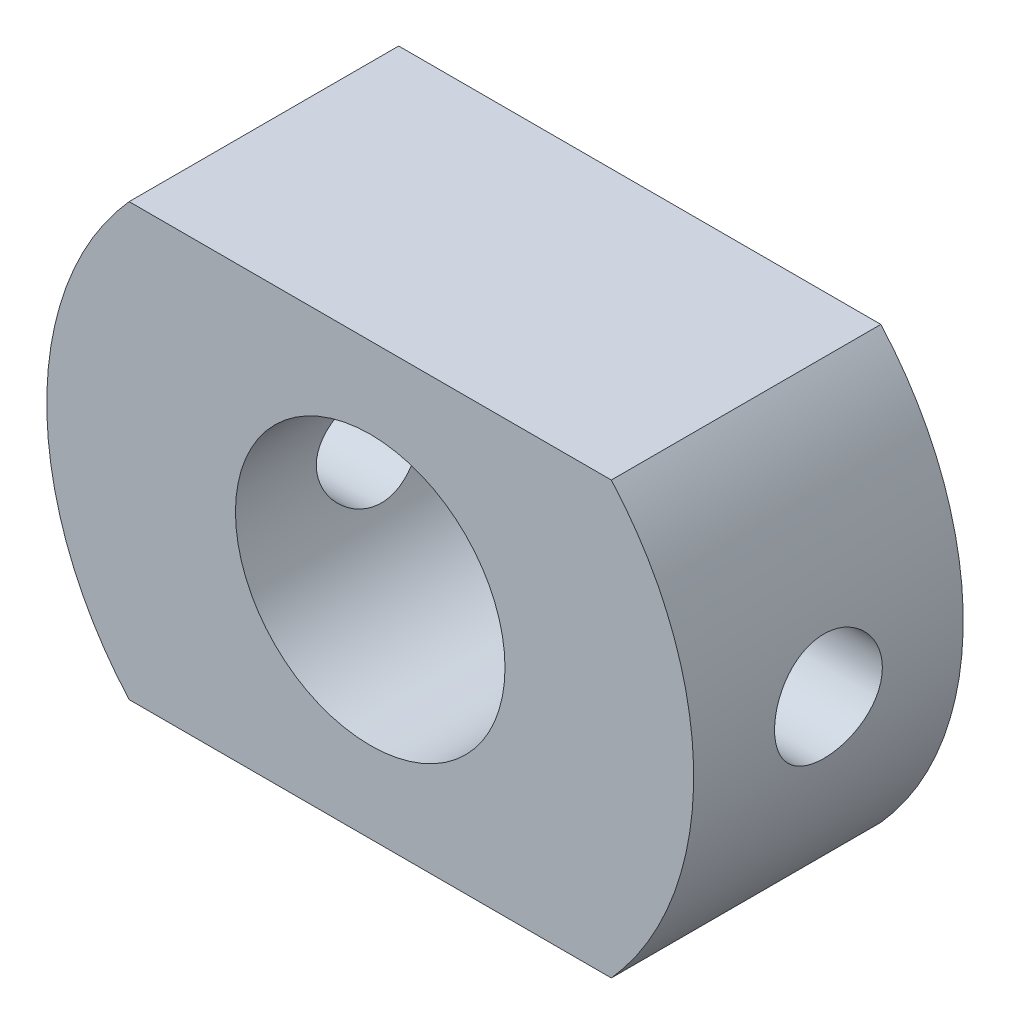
ISO-10303-21;
HEADER;
FILE_DESCRIPTION(('STEP AP214'),'2;1');
FILE_NAME('part.step','',(''),(''),'','','');
FILE_SCHEMA(('AUTOMOTIVE_DESIGN { 1 0 10303 214 1 1 1 1 }'));
ENDSEC;
DATA;
#1=APPLICATION_CONTEXT('core data for automotive mechanical design processes');
#2=APPLICATION_PROTOCOL_DEFINITION('international standard','automotive_design',2000,#1);
#3=PRODUCT_CONTEXT('',#1,'mechanical');
#4=PRODUCT('Part','Part','',(#3));
#5=PRODUCT_RELATED_PRODUCT_CATEGORY('part','',(#4));
#6=PRODUCT_DEFINITION_FORMATION('','',#4);
#7=PRODUCT_DEFINITION_CONTEXT('part definition',#1,'design');
#8=PRODUCT_DEFINITION('design','',#6,#7);
#9=PRODUCT_DEFINITION_SHAPE('','',#8);
#10=(LENGTH_UNIT() NAMED_UNIT(*) SI_UNIT(.MILLI.,.METRE.));
#11=(NAMED_UNIT(*) PLANE_ANGLE_UNIT() SI_UNIT($,.RADIAN.));
#12=(NAMED_UNIT(*) SI_UNIT($,.STERADIAN.) SOLID_ANGLE_UNIT());
#13=UNCERTAINTY_MEASURE_WITH_UNIT(LENGTH_MEASURE(1.E-05),#10,'distance_accuracy_value','');
#14=(GEOMETRIC_REPRESENTATION_CONTEXT(3) GLOBAL_UNCERTAINTY_ASSIGNED_CONTEXT((#13)) GLOBAL_UNIT_ASSIGNED_CONTEXT((#10,
#11,#12)) REPRESENTATION_CONTEXT('',''));
#15=CARTESIAN_POINT('',(0.,0.,0.));
#16=DIRECTION('',(0.,0.,1.));
#17=DIRECTION('',(1.,0.,0.));
#18=AXIS2_PLACEMENT_3D('',#15,#16,#17);
#19=CARTESIAN_POINT('',(0.,0.,5.));
#20=DIRECTION('',(0.,0.,1.));
#21=DIRECTION('',(1.,0.,0.));
#22=AXIS2_PLACEMENT_3D('',#19,#20,#21);
#23=PLANE('',#22);
#24=CARTESIAN_POINT('',(0.,0.,5.));
#25=DIRECTION('',(0.,0.,1.));
#26=DIRECTION('',(1.,0.,0.));
#27=AXIS2_PLACEMENT_3D('',#24,#25,#26);
#28=CIRCLE('',#27,6.);
#29=CARTESIAN_POINT('',(-4.47213595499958,4.,5.));
#30=VERTEX_POINT('',#29);
#31=CARTESIAN_POINT('',(-4.47213595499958,-4.,5.));
#32=VERTEX_POINT('',#31);
#33=EDGE_CURVE('E426',#30,#32,#28,.T.);
#34=ORIENTED_EDGE('',*,*,#33,.T.);
#35=DIRECTION('',(1.,0.,0.));
#36=VECTOR('',#35,1.);
#37=CARTESIAN_POINT('',(-4.47213595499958,-4.,5.));
#38=LINE('',#37,#36);
#39=CARTESIAN_POINT('',(4.47213595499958,-4.,5.));
#40=VERTEX_POINT('',#39);
#41=EDGE_CURVE('E411',#32,#40,#38,.T.);
#42=ORIENTED_EDGE('',*,*,#41,.T.);
#43=CARTESIAN_POINT('',(0.,0.,5.));
#44=DIRECTION('',(0.,0.,1.));
#45=DIRECTION('',(1.,0.,0.));
#46=AXIS2_PLACEMENT_3D('',#43,#44,#45);
#47=CIRCLE('',#46,6.);
#48=CARTESIAN_POINT('',(4.47213595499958,4.,5.));
#49=VERTEX_POINT('',#48);
#50=EDGE_CURVE('E377',#40,#49,#47,.T.);
#51=ORIENTED_EDGE('',*,*,#50,.T.);
#52=DIRECTION('',(-1.,0.,0.));
#53=VECTOR('',#52,1.);
#54=CARTESIAN_POINT('',(-4.47213595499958,4.,5.));
#55=LINE('',#54,#53);
#56=EDGE_CURVE('E372',#49,#30,#55,.T.);
#57=ORIENTED_EDGE('',*,*,#56,.T.);
#58=EDGE_LOOP('',(#34,#42,#51,#57));
#59=FACE_BOUND('',#58,.T.);
#60=CARTESIAN_POINT('',(0.,0.,5.));
#61=DIRECTION('',(0.,0.,1.));
#62=DIRECTION('',(1.,0.,0.));
#63=AXIS2_PLACEMENT_3D('',#60,#61,#62);
#64=CIRCLE('',#63,2.5);
#65=CARTESIAN_POINT('',(2.5,0.,5.));
#66=VERTEX_POINT('',#65);
#67=EDGE_CURVE('E416',#66,#66,#64,.T.);
#68=ORIENTED_EDGE('',*,*,#67,.F.);
#69=EDGE_LOOP('',(#68));
#70=FACE_BOUND('',#69,.T.);
#71=ADVANCED_FACE('F350',(#59,#70),#23,.T.);
#72=CARTESIAN_POINT('',(0.,0.,0.));
#73=DIRECTION('',(0.,0.,1.));
#74=DIRECTION('',(1.,0.,0.));
#75=AXIS2_PLACEMENT_3D('',#72,#73,#74);
#76=PLANE('',#75);
#77=CARTESIAN_POINT('',(0.,0.,0.));
#78=DIRECTION('',(0.,0.,1.));
#79=DIRECTION('',(1.,0.,0.));
#80=AXIS2_PLACEMENT_3D('',#77,#78,#79);
#81=CIRCLE('',#80,6.);
#82=CARTESIAN_POINT('',(-4.47213595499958,4.,0.));
#83=VERTEX_POINT('',#82);
#84=CARTESIAN_POINT('',(-4.47213595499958,-4.,0.));
#85=VERTEX_POINT('',#84);
#86=EDGE_CURVE('E403',#83,#85,#81,.T.);
#87=ORIENTED_EDGE('',*,*,#86,.F.);
#88=DIRECTION('',(-1.,0.,0.));
#89=VECTOR('',#88,1.);
#90=CARTESIAN_POINT('',(-4.47213595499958,4.,0.));
#91=LINE('',#90,#89);
#92=CARTESIAN_POINT('',(4.47213595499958,4.,0.));
#93=VERTEX_POINT('',#92);
#94=EDGE_CURVE('E424',#93,#83,#91,.T.);
#95=ORIENTED_EDGE('',*,*,#94,.F.);
#96=CARTESIAN_POINT('',(0.,0.,0.));
#97=DIRECTION('',(0.,0.,1.));
#98=DIRECTION('',(1.,0.,0.));
#99=AXIS2_PLACEMENT_3D('',#96,#97,#98);
#100=CIRCLE('',#99,6.);
#101=CARTESIAN_POINT('',(4.47213595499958,-4.,0.));
#102=VERTEX_POINT('',#101);
#103=EDGE_CURVE('E404',#102,#93,#100,.T.);
#104=ORIENTED_EDGE('',*,*,#103,.F.);
#105=DIRECTION('',(1.,0.,0.));
#106=VECTOR('',#105,1.);
#107=CARTESIAN_POINT('',(-4.47213595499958,-4.,0.));
#108=LINE('',#107,#106);
#109=EDGE_CURVE('E398',#85,#102,#108,.T.);
#110=ORIENTED_EDGE('',*,*,#109,.F.);
#111=EDGE_LOOP('',(#87,#95,#104,#110));
#112=FACE_BOUND('',#111,.T.);
#113=CARTESIAN_POINT('',(0.,0.,0.));
#114=DIRECTION('',(0.,0.,1.));
#115=DIRECTION('',(1.,0.,0.));
#116=AXIS2_PLACEMENT_3D('',#113,#114,#115);
#117=CIRCLE('',#116,2.5);
#118=CARTESIAN_POINT('',(2.5,0.,0.));
#119=VERTEX_POINT('',#118);
#120=EDGE_CURVE('E419',#119,#119,#117,.T.);
#121=ORIENTED_EDGE('',*,*,#120,.T.);
#122=EDGE_LOOP('',(#121));
#123=FACE_BOUND('',#122,.T.);
#124=ADVANCED_FACE('F399',(#112,#123),#76,.F.);
#125=CARTESIAN_POINT('',(0.,0.,5.));
#126=DIRECTION('',(0.,0.,-1.));
#127=DIRECTION('',(-1.,0.,0.));
#128=AXIS2_PLACEMENT_3D('',#125,#126,#127);
#129=CYLINDRICAL_SURFACE('',#128,6.);
#130=CARTESIAN_POINT('',(-6.,0.,1.5));
#131=CARTESIAN_POINT('',(-5.99999904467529,0.0557563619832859,1.50000223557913));
#132=CARTESIAN_POINT('',(-5.99921471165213,0.111543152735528,1.50467890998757));
#133=CARTESIAN_POINT('',(-5.99616137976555,0.221552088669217,1.52325426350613));
#134=CARTESIAN_POINT('',(-5.99389101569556,0.275772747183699,1.53716142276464));
#135=CARTESIAN_POINT('',(-5.9881202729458,0.381041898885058,1.5737661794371));
#136=CARTESIAN_POINT('',(-5.98462090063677,0.43209294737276,1.59645658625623));
#137=CARTESIAN_POINT('',(-5.97677690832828,0.529656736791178,1.64996491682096));
#138=CARTESIAN_POINT('',(-5.97243238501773,0.576169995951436,1.6807819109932));
#139=CARTESIAN_POINT('',(-5.96333326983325,0.663789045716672,1.74998203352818));
#140=CARTESIAN_POINT('',(-5.95857548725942,0.704845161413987,1.78842764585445));
#141=CARTESIAN_POINT('',(-5.94921050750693,0.779955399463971,1.87165918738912));
#142=CARTESIAN_POINT('',(-5.94460331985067,0.814009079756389,1.91644551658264));
#143=CARTESIAN_POINT('',(-5.93603026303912,0.874346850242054,2.01142838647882));
#144=CARTESIAN_POINT('',(-5.93206851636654,0.900581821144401,2.0616565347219));
#145=CARTESIAN_POINT('',(-5.9252791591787,0.944223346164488,2.16588382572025));
#146=CARTESIAN_POINT('',(-5.92245147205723,0.961630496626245,2.21988271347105));
#147=CARTESIAN_POINT('',(-5.91828214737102,0.986965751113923,2.32959210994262));
#148=CARTESIAN_POINT('',(-5.9169270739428,0.994979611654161,2.38528229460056));
#149=CARTESIAN_POINT('',(-5.9158157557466,1.00156669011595,2.49723211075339));
#150=CARTESIAN_POINT('',(-5.91605939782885,1.0001405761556,2.55349170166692));
#151=CARTESIAN_POINT('',(-5.91810571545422,0.987958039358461,2.66437114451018));
#152=CARTESIAN_POINT('',(-5.91989229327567,0.977297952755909,2.71900192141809));
#153=CARTESIAN_POINT('',(-5.92479798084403,0.947101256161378,2.82568852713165));
#154=CARTESIAN_POINT('',(-5.92791713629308,0.927564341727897,2.87774426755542));
#155=CARTESIAN_POINT('',(-5.9351539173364,0.880070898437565,2.97809152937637));
#156=CARTESIAN_POINT('',(-5.9392762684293,0.852074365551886,3.02636376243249));
#157=CARTESIAN_POINT('',(-5.94805167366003,0.788484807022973,3.11756176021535));
#158=CARTESIAN_POINT('',(-5.95270477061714,0.752891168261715,3.16048709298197));
#159=CARTESIAN_POINT('',(-5.96208811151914,0.674592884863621,3.24033043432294));
#160=CARTESIAN_POINT('',(-5.96681859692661,0.631805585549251,3.27716740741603));
#161=CARTESIAN_POINT('',(-5.97577040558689,0.540614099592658,3.34315110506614));
#162=CARTESIAN_POINT('',(-5.97999172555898,0.492209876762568,3.37229778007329));
#163=CARTESIAN_POINT('',(-5.98745557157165,0.391082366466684,3.42208089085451));
#164=CARTESIAN_POINT('',(-5.99069727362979,0.338355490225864,3.4427101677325));
#165=CARTESIAN_POINT('',(-5.99583001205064,0.230119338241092,3.47479768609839));
#166=CARTESIAN_POINT('',(-5.99772116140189,0.174610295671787,3.48625669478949));
#167=CARTESIAN_POINT('',(-5.99992451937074,0.0630839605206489,3.49956854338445));
#168=CARTESIAN_POINT('',(-6.00025501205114,0.00708029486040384,3.50153262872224));
#169=CARTESIAN_POINT('',(-5.99934989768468,-0.104455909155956,3.49609546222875));
#170=CARTESIAN_POINT('',(-5.99811435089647,-0.159988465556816,3.48869457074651));
#171=CARTESIAN_POINT('',(-5.99422730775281,-0.268662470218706,3.46483006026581));
#172=CARTESIAN_POINT('',(-5.99158441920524,-0.321816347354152,3.44842151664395));
#173=CARTESIAN_POINT('',(-5.98517785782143,-0.424618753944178,3.40706619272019));
#174=CARTESIAN_POINT('',(-5.98141412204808,-0.474267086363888,3.38211893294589));
#175=CARTESIAN_POINT('',(-5.97313806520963,-0.569132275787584,3.32413955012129));
#176=CARTESIAN_POINT('',(-5.96861942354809,-0.61430610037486,3.2910379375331));
#177=CARTESIAN_POINT('',(-5.9593538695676,-0.698497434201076,3.21778507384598));
#178=CARTESIAN_POINT('',(-5.95460694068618,-0.737514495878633,3.17763331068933));
#179=CARTESIAN_POINT('',(-5.94536070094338,-0.808697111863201,3.09092098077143));
#180=CARTESIAN_POINT('',(-5.94086446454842,-0.840787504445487,3.04429833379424));
#181=CARTESIAN_POINT('',(-5.93268611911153,-0.896680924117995,2.94625881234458));
#182=CARTESIAN_POINT('',(-5.92900398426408,-0.920484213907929,2.894842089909));
#183=CARTESIAN_POINT('',(-5.92289381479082,-0.95901533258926,2.78888410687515));
#184=CARTESIAN_POINT('',(-5.92046061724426,-0.973780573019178,2.7343567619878));
#185=CARTESIAN_POINT('',(-5.91711086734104,-0.993934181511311,2.62355194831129));
#186=CARTESIAN_POINT('',(-5.91619418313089,-0.999323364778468,2.56727463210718));
#187=CARTESIAN_POINT('',(-5.91598693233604,-1.00054914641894,2.45531793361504));
#188=CARTESIAN_POINT('',(-5.9166762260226,-0.996504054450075,2.39963984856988));
#189=CARTESIAN_POINT('',(-5.91955912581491,-0.979231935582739,2.28976830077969));
#190=CARTESIAN_POINT('',(-5.92175272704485,-0.96600493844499,2.23557483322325));
#191=CARTESIAN_POINT('',(-5.92738942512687,-0.930789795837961,2.13025662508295));
#192=CARTESIAN_POINT('',(-5.93083106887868,-0.908811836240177,2.07912839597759));
#193=CARTESIAN_POINT('',(-5.93857747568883,-0.856730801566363,1.98126573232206));
#194=CARTESIAN_POINT('',(-5.94288228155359,-0.826627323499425,1.93453151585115));
#195=CARTESIAN_POINT('',(-5.95193381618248,-0.758727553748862,1.8461857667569));
#196=CARTESIAN_POINT('',(-5.95668518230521,-0.720844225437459,1.80464159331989));
#197=CARTESIAN_POINT('',(-5.96605748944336,-0.638643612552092,1.72845935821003));
#198=CARTESIAN_POINT('',(-5.97067840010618,-0.594324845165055,1.69382289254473));
#199=CARTESIAN_POINT('',(-5.97930611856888,-0.500147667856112,1.63222069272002));
#200=CARTESIAN_POINT('',(-5.98330846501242,-0.450253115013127,1.60530958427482));
#201=CARTESIAN_POINT('',(-5.9902046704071,-0.346605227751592,1.56029220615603));
#202=CARTESIAN_POINT('',(-5.99309963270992,-0.292855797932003,1.54217716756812));
#203=CARTESIAN_POINT('',(-5.99682316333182,-0.19908132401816,1.51919789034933));
#204=CARTESIAN_POINT('',(-5.99800810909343,-0.159623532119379,1.51201021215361));
#205=CARTESIAN_POINT('',(-5.99959686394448,-0.0801157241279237,1.5024105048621));
#206=CARTESIAN_POINT('',(-6.00000068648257,-0.0400657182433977,1.49999839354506));
#207=CARTESIAN_POINT('',(-6.,0.,1.5));
#208=B_SPLINE_CURVE_WITH_KNOTS('',3,(#130,#131,#132,#133,#134,#135,#136,#137,#138,#139,#140,
#141,#142,#143,#144,#145,#146,#147,#148,#149,#150,#151,#152,#153,#154,#155,#156,#157,#158,#159,
#160,#161,#162,#163,#164,#165,#166,#167,#168,#169,#170,#171,#172,#173,#174,#175,#176,#177,#178,
#179,#180,#181,#182,#183,#184,#185,#186,#187,#188,#189,#190,#191,#192,#193,#194,#195,#196,#197,
#198,#199,#200,#201,#202,#203,#204,#205,#206,#207),.UNSPECIFIED.,.T.,.F.,(4,2,2,2,2,2,2,2,2,2,2,
2,2,2,2,2,2,2,2,2,2,2,2,2,2,2,2,2,2,2,2,2,2,2,2,2,2,2,4),(0.,0.167122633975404,
0.334399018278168,0.501538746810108,0.668659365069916,0.837209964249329,1.00577120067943,
1.17537008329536,1.34495750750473,1.5129843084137,1.68099921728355,1.84728208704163,
2.01357066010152,2.18065822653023,2.34775928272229,2.51693107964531,2.68610396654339,
2.85541875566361,3.0247193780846,3.19203153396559,3.35933725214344,3.52563122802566,
3.69193454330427,3.8597073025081,4.02749225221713,4.19701528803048,4.36653294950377,
4.53534408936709,4.70414055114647,4.8708316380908,5.03752218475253,5.20401927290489,
5.37052462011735,5.53900553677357,5.70752533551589,5.8772089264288,6.04672300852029,
6.16681699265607,6.28690890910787),.UNSPECIFIED.);
#209=CARTESIAN_POINT('',(-6.,0.,1.5));
#210=VERTEX_POINT('',#209);
#211=EDGE_CURVE('E457',#210,#210,#208,.T.);
#212=ORIENTED_EDGE('',*,*,#211,.T.);
#213=EDGE_LOOP('',(#212));
#214=FACE_BOUND('',#213,.T.);
#215=ORIENTED_EDGE('',*,*,#86,.T.);
#216=DIRECTION('',(0.,0.,-1.));
#217=VECTOR('',#216,1.);
#218=CARTESIAN_POINT('',(-4.47213595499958,-4.,5.));
#219=LINE('',#218,#217);
#220=EDGE_CURVE('E11',#32,#85,#219,.T.);
#221=ORIENTED_EDGE('',*,*,#220,.F.);
#222=ORIENTED_EDGE('',*,*,#33,.F.);
#223=DIRECTION('',(0.,0.,-1.));
#224=VECTOR('',#223,1.);
#225=CARTESIAN_POINT('',(-4.47213595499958,4.,5.));
#226=LINE('',#225,#224);
#227=EDGE_CURVE('E415',#30,#83,#226,.T.);
#228=ORIENTED_EDGE('',*,*,#227,.T.);
#229=EDGE_LOOP('',(#215,#221,#222,#228));
#230=FACE_BOUND('',#229,.T.);
#231=ADVANCED_FACE('F352',(#214,#230),#129,.T.);
#232=CARTESIAN_POINT('',(-4.47213595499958,-4.,5.));
#233=DIRECTION('',(0.,1.,0.));
#234=DIRECTION('',(0.,0.,1.));
#235=AXIS2_PLACEMENT_3D('',#232,#233,#234);
#236=PLANE('',#235);
#237=ORIENTED_EDGE('',*,*,#109,.T.);
#238=DIRECTION('',(0.,0.,-1.));
#239=VECTOR('',#238,1.);
#240=CARTESIAN_POINT('',(4.47213595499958,-4.,5.));
#241=LINE('',#240,#239);
#242=EDGE_CURVE('E364',#40,#102,#241,.T.);
#243=ORIENTED_EDGE('',*,*,#242,.F.);
#244=ORIENTED_EDGE('',*,*,#41,.F.);
#245=ORIENTED_EDGE('',*,*,#220,.T.);
#246=EDGE_LOOP('',(#237,#243,#244,#245));
#247=FACE_BOUND('',#246,.T.);
#248=ADVANCED_FACE('F410',(#247),#236,.F.);
#249=CARTESIAN_POINT('',(0.,0.,5.));
#250=DIRECTION('',(0.,0.,-1.));
#251=DIRECTION('',(-1.,0.,0.));
#252=AXIS2_PLACEMENT_3D('',#249,#250,#251);
#253=CYLINDRICAL_SURFACE('',#252,6.);
#254=CARTESIAN_POINT('',(6.,0.,1.5));
#255=CARTESIAN_POINT('',(5.99999904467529,-0.0557563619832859,1.50000223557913));
#256=CARTESIAN_POINT('',(5.99921471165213,-0.111543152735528,1.50467890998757));
#257=CARTESIAN_POINT('',(5.99616137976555,-0.221552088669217,1.52325426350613));
#258=CARTESIAN_POINT('',(5.99389101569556,-0.275772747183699,1.53716142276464));
#259=CARTESIAN_POINT('',(5.9881202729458,-0.381041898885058,1.5737661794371));
#260=CARTESIAN_POINT('',(5.98462090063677,-0.43209294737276,1.59645658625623));
#261=CARTESIAN_POINT('',(5.97677690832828,-0.529656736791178,1.64996491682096));
#262=CARTESIAN_POINT('',(5.97243238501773,-0.576169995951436,1.6807819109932));
#263=CARTESIAN_POINT('',(5.96333326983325,-0.663789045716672,1.74998203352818));
#264=CARTESIAN_POINT('',(5.95857548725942,-0.704845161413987,1.78842764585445));
#265=CARTESIAN_POINT('',(5.94921050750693,-0.779955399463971,1.87165918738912));
#266=CARTESIAN_POINT('',(5.94460331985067,-0.814009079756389,1.91644551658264));
#267=CARTESIAN_POINT('',(5.93603026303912,-0.874346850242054,2.01142838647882));
#268=CARTESIAN_POINT('',(5.93206851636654,-0.900581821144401,2.0616565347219));
#269=CARTESIAN_POINT('',(5.9252791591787,-0.944223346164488,2.16588382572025));
#270=CARTESIAN_POINT('',(5.92245147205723,-0.961630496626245,2.21988271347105));
#271=CARTESIAN_POINT('',(5.91828214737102,-0.986965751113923,2.32959210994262));
#272=CARTESIAN_POINT('',(5.9169270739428,-0.994979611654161,2.38528229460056));
#273=CARTESIAN_POINT('',(5.9158157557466,-1.00156669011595,2.49723211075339));
#274=CARTESIAN_POINT('',(5.91605939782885,-1.0001405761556,2.55349170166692));
#275=CARTESIAN_POINT('',(5.91810571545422,-0.987958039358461,2.66437114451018));
#276=CARTESIAN_POINT('',(5.91989229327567,-0.977297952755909,2.71900192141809));
#277=CARTESIAN_POINT('',(5.92479798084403,-0.947101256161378,2.82568852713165));
#278=CARTESIAN_POINT('',(5.92791713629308,-0.927564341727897,2.87774426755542));
#279=CARTESIAN_POINT('',(5.9351539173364,-0.880070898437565,2.97809152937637));
#280=CARTESIAN_POINT('',(5.9392762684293,-0.852074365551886,3.02636376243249));
#281=CARTESIAN_POINT('',(5.94805167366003,-0.788484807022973,3.11756176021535));
#282=CARTESIAN_POINT('',(5.95270477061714,-0.752891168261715,3.16048709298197));
#283=CARTESIAN_POINT('',(5.96208811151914,-0.674592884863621,3.24033043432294));
#284=CARTESIAN_POINT('',(5.96681859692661,-0.631805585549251,3.27716740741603));
#285=CARTESIAN_POINT('',(5.97577040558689,-0.540614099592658,3.34315110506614));
#286=CARTESIAN_POINT('',(5.97999172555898,-0.492209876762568,3.37229778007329));
#287=CARTESIAN_POINT('',(5.98745557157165,-0.391082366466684,3.42208089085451));
#288=CARTESIAN_POINT('',(5.99069727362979,-0.338355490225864,3.4427101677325));
#289=CARTESIAN_POINT('',(5.99583001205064,-0.230119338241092,3.47479768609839));
#290=CARTESIAN_POINT('',(5.99772116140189,-0.174610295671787,3.48625669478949));
#291=CARTESIAN_POINT('',(5.99992451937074,-0.0630839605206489,3.49956854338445));
#292=CARTESIAN_POINT('',(6.00025501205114,-0.00708029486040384,3.50153262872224));
#293=CARTESIAN_POINT('',(5.99934989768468,0.104455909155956,3.49609546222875));
#294=CARTESIAN_POINT('',(5.99811435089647,0.159988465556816,3.48869457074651));
#295=CARTESIAN_POINT('',(5.99422730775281,0.268662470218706,3.46483006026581));
#296=CARTESIAN_POINT('',(5.99158441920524,0.321816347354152,3.44842151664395));
#297=CARTESIAN_POINT('',(5.98517785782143,0.424618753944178,3.40706619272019));
#298=CARTESIAN_POINT('',(5.98141412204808,0.474267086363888,3.38211893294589));
#299=CARTESIAN_POINT('',(5.97313806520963,0.569132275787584,3.32413955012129));
#300=CARTESIAN_POINT('',(5.96861942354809,0.61430610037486,3.2910379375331));
#301=CARTESIAN_POINT('',(5.9593538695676,0.698497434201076,3.21778507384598));
#302=CARTESIAN_POINT('',(5.95460694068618,0.737514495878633,3.17763331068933));
#303=CARTESIAN_POINT('',(5.94536070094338,0.808697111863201,3.09092098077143));
#304=CARTESIAN_POINT('',(5.94086446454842,0.840787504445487,3.04429833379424));
#305=CARTESIAN_POINT('',(5.93268611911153,0.896680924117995,2.94625881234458));
#306=CARTESIAN_POINT('',(5.92900398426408,0.920484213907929,2.894842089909));
#307=CARTESIAN_POINT('',(5.92289381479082,0.95901533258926,2.78888410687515));
#308=CARTESIAN_POINT('',(5.92046061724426,0.973780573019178,2.7343567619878));
#309=CARTESIAN_POINT('',(5.91711086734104,0.993934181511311,2.62355194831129));
#310=CARTESIAN_POINT('',(5.91619418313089,0.999323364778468,2.56727463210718));
#311=CARTESIAN_POINT('',(5.91598693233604,1.00054914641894,2.45531793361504));
#312=CARTESIAN_POINT('',(5.9166762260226,0.996504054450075,2.39963984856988));
#313=CARTESIAN_POINT('',(5.91955912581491,0.979231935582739,2.28976830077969));
#314=CARTESIAN_POINT('',(5.92175272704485,0.96600493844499,2.23557483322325));
#315=CARTESIAN_POINT('',(5.92738942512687,0.930789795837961,2.13025662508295));
#316=CARTESIAN_POINT('',(5.93083106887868,0.908811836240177,2.07912839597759));
#317=CARTESIAN_POINT('',(5.93857747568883,0.856730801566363,1.98126573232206));
#318=CARTESIAN_POINT('',(5.94288228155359,0.826627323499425,1.93453151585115));
#319=CARTESIAN_POINT('',(5.95193381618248,0.758727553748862,1.8461857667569));
#320=CARTESIAN_POINT('',(5.95668518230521,0.720844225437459,1.80464159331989));
#321=CARTESIAN_POINT('',(5.96605748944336,0.638643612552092,1.72845935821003));
#322=CARTESIAN_POINT('',(5.97067840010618,0.594324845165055,1.69382289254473));
#323=CARTESIAN_POINT('',(5.97930611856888,0.500147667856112,1.63222069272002));
#324=CARTESIAN_POINT('',(5.98330846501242,0.450253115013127,1.60530958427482));
#325=CARTESIAN_POINT('',(5.9902046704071,0.346605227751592,1.56029220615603));
#326=CARTESIAN_POINT('',(5.99309963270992,0.292855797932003,1.54217716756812));
#327=CARTESIAN_POINT('',(5.99682316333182,0.19908132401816,1.51919789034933));
#328=CARTESIAN_POINT('',(5.99800810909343,0.159623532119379,1.51201021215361));
#329=CARTESIAN_POINT('',(5.99959686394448,0.0801157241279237,1.5024105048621));
#330=CARTESIAN_POINT('',(6.00000068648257,0.0400657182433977,1.49999839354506));
#331=CARTESIAN_POINT('',(6.,0.,1.5));
#332=B_SPLINE_CURVE_WITH_KNOTS('',3,(#254,#255,#256,#257,#258,#259,#260,#261,#262,#263,#264,
#265,#266,#267,#268,#269,#270,#271,#272,#273,#274,#275,#276,#277,#278,#279,#280,#281,#282,#283,
#284,#285,#286,#287,#288,#289,#290,#291,#292,#293,#294,#295,#296,#297,#298,#299,#300,#301,#302,
#303,#304,#305,#306,#307,#308,#309,#310,#311,#312,#313,#314,#315,#316,#317,#318,#319,#320,#321,
#322,#323,#324,#325,#326,#327,#328,#329,#330,#331),.UNSPECIFIED.,.T.,.F.,(4,2,2,2,2,2,2,2,2,2,2,
2,2,2,2,2,2,2,2,2,2,2,2,2,2,2,2,2,2,2,2,2,2,2,2,2,2,2,4),(0.,0.167122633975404,
0.334399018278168,0.501538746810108,0.668659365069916,0.837209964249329,1.00577120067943,
1.17537008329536,1.34495750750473,1.5129843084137,1.68099921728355,1.84728208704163,
2.01357066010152,2.18065822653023,2.34775928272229,2.51693107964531,2.68610396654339,
2.85541875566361,3.0247193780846,3.19203153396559,3.35933725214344,3.52563122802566,
3.69193454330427,3.8597073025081,4.02749225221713,4.19701528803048,4.36653294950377,
4.53534408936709,4.70414055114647,4.8708316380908,5.03752218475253,5.20401927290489,
5.37052462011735,5.53900553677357,5.70752533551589,5.8772089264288,6.04672300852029,
6.16681699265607,6.28690890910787),.UNSPECIFIED.);
#333=CARTESIAN_POINT('',(6.,0.,1.5));
#334=VERTEX_POINT('',#333);
#335=EDGE_CURVE('E452',#334,#334,#332,.T.);
#336=ORIENTED_EDGE('',*,*,#335,.T.);
#337=EDGE_LOOP('',(#336));
#338=FACE_BOUND('',#337,.T.);
#339=ORIENTED_EDGE('',*,*,#103,.T.);
#340=DIRECTION('',(0.,0.,-1.));
#341=VECTOR('',#340,1.);
#342=CARTESIAN_POINT('',(4.47213595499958,4.,5.));
#343=LINE('',#342,#341);
#344=EDGE_CURVE('E432',#49,#93,#343,.T.);
#345=ORIENTED_EDGE('',*,*,#344,.F.);
#346=ORIENTED_EDGE('',*,*,#50,.F.);
#347=ORIENTED_EDGE('',*,*,#242,.T.);
#348=EDGE_LOOP('',(#339,#345,#346,#347));
#349=FACE_BOUND('',#348,.T.);
#350=ADVANCED_FACE('F460',(#338,#349),#253,.T.);
#351=CARTESIAN_POINT('',(-4.47213595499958,4.,5.));
#352=DIRECTION('',(0.,-1.,0.));
#353=DIRECTION('',(0.,0.,-1.));
#354=AXIS2_PLACEMENT_3D('',#351,#352,#353);
#355=PLANE('',#354);
#356=ORIENTED_EDGE('',*,*,#94,.T.);
#357=ORIENTED_EDGE('',*,*,#227,.F.);
#358=ORIENTED_EDGE('',*,*,#56,.F.);
#359=ORIENTED_EDGE('',*,*,#344,.T.);
#360=EDGE_LOOP('',(#356,#357,#358,#359));
#361=FACE_BOUND('',#360,.T.);
#362=ADVANCED_FACE('F464',(#361),#355,.F.);
#363=CARTESIAN_POINT('',(0.,0.,5.));
#364=DIRECTION('',(0.,0.,-1.));
#365=DIRECTION('',(-1.,0.,0.));
#366=AXIS2_PLACEMENT_3D('',#363,#364,#365);
#367=CYLINDRICAL_SURFACE('',#366,2.5);
#368=CARTESIAN_POINT('',(-2.5,0.,3.5));
#369=CARTESIAN_POINT('',(-2.49999635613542,-0.0537465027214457,3.49999507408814));
#370=CARTESIAN_POINT('',(-2.49824647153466,-0.107586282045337,3.49564112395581));
#371=CARTESIAN_POINT('',(-2.49141726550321,-0.213748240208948,3.47837614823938));
#372=CARTESIAN_POINT('',(-2.48632889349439,-0.266065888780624,3.46544186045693));
#373=CARTESIAN_POINT('',(-2.47337104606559,-0.367476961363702,3.43156196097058));
#374=CARTESIAN_POINT('',(-2.46551068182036,-0.41658033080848,3.41064257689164));
#375=CARTESIAN_POINT('',(-2.44778305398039,-0.510535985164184,3.36149041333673));
#376=CARTESIAN_POINT('',(-2.43791648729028,-0.555389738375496,3.33326017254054));
#377=CARTESIAN_POINT('',(-2.41665443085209,-0.641750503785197,3.26888225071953));
#378=CARTESIAN_POINT('',(-2.40521148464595,-0.683031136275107,3.23244667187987));
#379=CARTESIAN_POINT('',(-2.38230288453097,-0.759087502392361,3.15329999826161));
#380=CARTESIAN_POINT('',(-2.37083722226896,-0.793860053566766,3.11058585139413));
#381=CARTESIAN_POINT('',(-2.34861395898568,-0.85743728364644,3.01778596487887));
#382=CARTESIAN_POINT('',(-2.33791057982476,-0.885907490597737,2.9674567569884));
#383=CARTESIAN_POINT('',(-2.31916823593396,-0.933877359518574,2.86223180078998));
#384=CARTESIAN_POINT('',(-2.31112800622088,-0.953381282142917,2.80733823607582));
#385=CARTESIAN_POINT('',(-2.29913178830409,-0.981949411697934,2.69714383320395));
#386=CARTESIAN_POINT('',(-2.29500710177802,-0.991446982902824,2.64197438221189));
#387=CARTESIAN_POINT('',(-2.29082002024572,-1.00108648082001,2.53068250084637));
#388=CARTESIAN_POINT('',(-2.29075562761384,-1.00123300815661,2.47456055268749));
#389=CARTESIAN_POINT('',(-2.29455250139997,-0.992494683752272,2.36712166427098));
#390=CARTESIAN_POINT('',(-2.29814087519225,-0.984237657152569,2.31574214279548));
#391=CARTESIAN_POINT('',(-2.30838093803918,-0.95997344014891,2.21517022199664));
#392=CARTESIAN_POINT('',(-2.31503316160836,-0.943964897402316,2.16597820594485));
#393=CARTESIAN_POINT('',(-2.33079742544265,-0.904347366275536,2.06999108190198));
#394=CARTESIAN_POINT('',(-2.33995689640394,-0.880589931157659,2.02326538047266));
#395=CARTESIAN_POINT('',(-2.35969058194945,-0.826253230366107,1.93429209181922));
#396=CARTESIAN_POINT('',(-2.37026532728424,-0.795671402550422,1.8920461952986));
#397=CARTESIAN_POINT('',(-2.39263368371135,-0.725775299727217,1.809795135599));
#398=CARTESIAN_POINT('',(-2.40445832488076,-0.685968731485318,1.77021563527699));
#399=CARTESIAN_POINT('',(-2.42729912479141,-0.600157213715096,1.69815776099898));
#400=CARTESIAN_POINT('',(-2.43831512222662,-0.554151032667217,1.66568080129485));
#401=CARTESIAN_POINT('',(-2.45857340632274,-0.456038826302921,1.60819127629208));
#402=CARTESIAN_POINT('',(-2.46777635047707,-0.403830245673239,1.58333885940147));
#403=CARTESIAN_POINT('',(-2.48307414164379,-0.295511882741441,1.54291606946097));
#404=CARTESIAN_POINT('',(-2.48917056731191,-0.239404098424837,1.5273409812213));
#405=CARTESIAN_POINT('',(-2.49728069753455,-0.12844794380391,1.50677585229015));
#406=CARTESIAN_POINT('',(-2.49951472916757,-0.0737216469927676,1.50121377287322));
#407=CARTESIAN_POINT('',(-2.50034239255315,0.0359226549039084,1.49914344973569));
#408=CARTESIAN_POINT('',(-2.49893696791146,0.0908406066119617,1.50263285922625));
#409=CARTESIAN_POINT('',(-2.49278783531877,0.196716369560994,1.518145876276));
#410=CARTESIAN_POINT('',(-2.48819695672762,0.247741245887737,1.52977899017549));
#411=CARTESIAN_POINT('',(-2.4762972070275,0.34706771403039,1.56071785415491));
#412=CARTESIAN_POINT('',(-2.46898798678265,0.395368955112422,1.58002458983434));
#413=CARTESIAN_POINT('',(-2.45208297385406,0.489539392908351,1.62639246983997));
#414=CARTESIAN_POINT('',(-2.44242407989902,0.535289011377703,1.65367273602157));
#415=CARTESIAN_POINT('',(-2.42186682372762,0.621721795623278,1.71497016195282));
#416=CARTESIAN_POINT('',(-2.41096796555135,0.662402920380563,1.74899002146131));
#417=CARTESIAN_POINT('',(-2.38822558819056,0.74036152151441,1.82543500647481));
#418=CARTESIAN_POINT('',(-2.37636720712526,0.777236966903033,1.8682667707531));
#419=CARTESIAN_POINT('',(-2.35370836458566,0.843375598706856,1.95972004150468));
#420=CARTESIAN_POINT('',(-2.34290807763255,0.872637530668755,2.00834250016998));
#421=CARTESIAN_POINT('',(-2.32357149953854,0.922903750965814,2.11073084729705));
#422=CARTESIAN_POINT('',(-2.31505815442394,0.943825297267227,2.16454199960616));
#423=CARTESIAN_POINT('',(-2.30161836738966,0.976148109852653,2.27536682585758));
#424=CARTESIAN_POINT('',(-2.29668927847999,0.987556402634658,2.33237810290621));
#425=CARTESIAN_POINT('',(-2.29135879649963,0.999857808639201,2.44356395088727));
#426=CARTESIAN_POINT('',(-2.29065710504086,1.00144854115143,2.49764741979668));
#427=CARTESIAN_POINT('',(-2.29307418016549,0.995901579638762,2.60527242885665));
#428=CARTESIAN_POINT('',(-2.29619246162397,0.988764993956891,2.65881403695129));
#429=CARTESIAN_POINT('',(-2.3056332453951,0.966535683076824,2.76166609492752));
#430=CARTESIAN_POINT('',(-2.31182415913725,0.951768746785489,2.8110601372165));
#431=CARTESIAN_POINT('',(-2.32662000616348,0.915002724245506,2.90668931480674));
#432=CARTESIAN_POINT('',(-2.33522560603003,0.893001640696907,2.95292357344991));
#433=CARTESIAN_POINT('',(-2.35449304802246,0.840936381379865,3.04380480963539));
#434=CARTESIAN_POINT('',(-2.36524441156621,0.810482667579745,3.08820933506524));
#435=CARTESIAN_POINT('',(-2.38731902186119,0.742946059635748,3.17149665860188));
#436=CARTESIAN_POINT('',(-2.39864244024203,0.70586116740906,3.21037778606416));
#437=CARTESIAN_POINT('',(-2.42146783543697,0.623252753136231,3.28410142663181));
#438=CARTESIAN_POINT('',(-2.43293378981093,0.577338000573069,3.31851865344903));
#439=CARTESIAN_POINT('',(-2.45400203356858,0.479950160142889,3.37916852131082));
#440=CARTESIAN_POINT('',(-2.46360345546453,0.428474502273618,3.40539735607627));
#441=CARTESIAN_POINT('',(-2.47969857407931,0.322369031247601,3.44831110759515));
#442=CARTESIAN_POINT('',(-2.48624681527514,0.267815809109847,3.46516466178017));
#443=CARTESIAN_POINT('',(-2.49572153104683,0.15643827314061,3.48931956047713));
#444=CARTESIAN_POINT('',(-2.49865949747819,0.0996217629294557,3.49665121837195));
#445=CARTESIAN_POINT('',(-2.49987949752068,0.0284561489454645,3.49969769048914));
#446=CARTESIAN_POINT('',(-2.50000096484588,0.014231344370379,3.5000013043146));
#447=CARTESIAN_POINT('',(-2.5,0.,3.5));
#448=B_SPLINE_CURVE_WITH_KNOTS('',3,(#368,#369,#370,#371,#372,#373,#374,#375,#376,#377,#378,
#379,#380,#381,#382,#383,#384,#385,#386,#387,#388,#389,#390,#391,#392,#393,#394,#395,#396,#397,
#398,#399,#400,#401,#402,#403,#404,#405,#406,#407,#408,#409,#410,#411,#412,#413,#414,#415,#416,
#417,#418,#419,#420,#421,#422,#423,#424,#425,#426,#427,#428,#429,#430,#431,#432,#433,#434,#435,
#436,#437,#438,#439,#440,#441,#442,#443,#444,#445,#446,#447),.UNSPECIFIED.,.T.,.F.,(4,2,2,2,2,2,
2,2,2,2,2,2,2,2,2,2,2,2,2,2,2,2,2,2,2,2,2,2,2,2,2,2,2,2,2,2,2,2,2,4),(0.,0.161201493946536,
0.322841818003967,0.483955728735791,0.645013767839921,0.812986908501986,0.981041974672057,
1.15657629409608,1.33202711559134,1.49952052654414,1.66693153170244,1.82269164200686,
1.97847893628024,2.13744563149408,2.29647210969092,2.46779174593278,2.63914546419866,
2.81388456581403,2.98853478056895,3.15284592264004,3.31711446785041,3.47400227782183,
3.63091024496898,3.79261756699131,3.95438979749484,4.12684237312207,4.29932334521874,
4.47347522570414,4.64749836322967,4.80899836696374,4.97047786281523,5.12557159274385,
5.28070817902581,5.44472734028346,5.60879600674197,5.78350211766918,5.95828931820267,
6.1298215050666,6.30080626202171,6.34349022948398),.UNSPECIFIED.);
#449=CARTESIAN_POINT('',(-2.5,0.,3.5));
#450=VERTEX_POINT('',#449);
#451=EDGE_CURVE('E355',#450,#450,#448,.T.);
#452=ORIENTED_EDGE('',*,*,#451,.F.);
#453=EDGE_LOOP('',(#452));
#454=FACE_BOUND('',#453,.T.);
#455=CARTESIAN_POINT('',(2.5,0.,1.5));
#456=CARTESIAN_POINT('',(2.49999635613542,-0.0537465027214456,1.50000492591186));
#457=CARTESIAN_POINT('',(2.49824647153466,-0.107586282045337,1.50435887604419));
#458=CARTESIAN_POINT('',(2.49141726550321,-0.213748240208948,1.52162385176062));
#459=CARTESIAN_POINT('',(2.48632889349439,-0.266065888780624,1.53455813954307));
#460=CARTESIAN_POINT('',(2.47337104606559,-0.367476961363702,1.56843803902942));
#461=CARTESIAN_POINT('',(2.46551068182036,-0.416580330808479,1.58935742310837));
#462=CARTESIAN_POINT('',(2.44778305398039,-0.510535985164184,1.63850958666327));
#463=CARTESIAN_POINT('',(2.43791648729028,-0.555389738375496,1.66673982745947));
#464=CARTESIAN_POINT('',(2.41665443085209,-0.641750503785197,1.73111774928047));
#465=CARTESIAN_POINT('',(2.40521148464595,-0.683031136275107,1.76755332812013));
#466=CARTESIAN_POINT('',(2.38230288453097,-0.759087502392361,1.84670000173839));
#467=CARTESIAN_POINT('',(2.37083722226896,-0.793860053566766,1.88941414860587));
#468=CARTESIAN_POINT('',(2.34861395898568,-0.857437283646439,1.98221403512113));
#469=CARTESIAN_POINT('',(2.33791057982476,-0.885907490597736,2.0325432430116));
#470=CARTESIAN_POINT('',(2.31916823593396,-0.933877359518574,2.13776819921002));
#471=CARTESIAN_POINT('',(2.31112800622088,-0.953381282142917,2.19266176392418));
#472=CARTESIAN_POINT('',(2.29913178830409,-0.981949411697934,2.30285616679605));
#473=CARTESIAN_POINT('',(2.29500710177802,-0.991446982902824,2.35802561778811));
#474=CARTESIAN_POINT('',(2.29082002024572,-1.00108648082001,2.46931749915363));
#475=CARTESIAN_POINT('',(2.29075562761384,-1.00123300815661,2.52543944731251));
#476=CARTESIAN_POINT('',(2.29455250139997,-0.992494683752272,2.63287833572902));
#477=CARTESIAN_POINT('',(2.29814087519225,-0.984237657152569,2.68425785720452));
#478=CARTESIAN_POINT('',(2.30838093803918,-0.95997344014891,2.78482977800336));
#479=CARTESIAN_POINT('',(2.31503316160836,-0.943964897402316,2.83402179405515));
#480=CARTESIAN_POINT('',(2.33079742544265,-0.904347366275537,2.93000891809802));
#481=CARTESIAN_POINT('',(2.33995689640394,-0.880589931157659,2.97673461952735));
#482=CARTESIAN_POINT('',(2.35969058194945,-0.826253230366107,3.06570790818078));
#483=CARTESIAN_POINT('',(2.37026532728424,-0.795671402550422,3.1079538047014));
#484=CARTESIAN_POINT('',(2.39263368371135,-0.725775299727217,3.190204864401));
#485=CARTESIAN_POINT('',(2.40445832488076,-0.685968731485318,3.22978436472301));
#486=CARTESIAN_POINT('',(2.42729912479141,-0.600157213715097,3.30184223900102));
#487=CARTESIAN_POINT('',(2.43831512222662,-0.554151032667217,3.33431919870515));
#488=CARTESIAN_POINT('',(2.45857340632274,-0.456038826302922,3.39180872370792));
#489=CARTESIAN_POINT('',(2.46777635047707,-0.403830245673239,3.41666114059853));
#490=CARTESIAN_POINT('',(2.48307414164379,-0.295511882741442,3.45708393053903));
#491=CARTESIAN_POINT('',(2.48917056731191,-0.239404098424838,3.47265901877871));
#492=CARTESIAN_POINT('',(2.49728069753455,-0.128447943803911,3.49322414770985));
#493=CARTESIAN_POINT('',(2.49951472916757,-0.0737216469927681,3.49878622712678));
#494=CARTESIAN_POINT('',(2.50034239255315,0.0359226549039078,3.50085655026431));
#495=CARTESIAN_POINT('',(2.49893696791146,0.0908406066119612,3.49736714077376));
#496=CARTESIAN_POINT('',(2.49278783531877,0.196716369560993,3.48185412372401));
#497=CARTESIAN_POINT('',(2.48819695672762,0.247741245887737,3.47022100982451));
#498=CARTESIAN_POINT('',(2.4762972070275,0.34706771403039,3.43928214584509));
#499=CARTESIAN_POINT('',(2.46898798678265,0.395368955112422,3.41997541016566));
#500=CARTESIAN_POINT('',(2.45208297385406,0.489539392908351,3.37360753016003));
#501=CARTESIAN_POINT('',(2.44242407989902,0.535289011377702,3.34632726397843));
#502=CARTESIAN_POINT('',(2.42186682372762,0.621721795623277,3.28502983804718));
#503=CARTESIAN_POINT('',(2.41096796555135,0.662402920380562,3.25100997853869));
#504=CARTESIAN_POINT('',(2.38822558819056,0.740361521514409,3.17456499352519));
#505=CARTESIAN_POINT('',(2.37636720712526,0.777236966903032,3.1317332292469));
#506=CARTESIAN_POINT('',(2.35370836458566,0.843375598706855,3.04027995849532));
#507=CARTESIAN_POINT('',(2.34290807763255,0.872637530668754,2.99165749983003));
#508=CARTESIAN_POINT('',(2.32357149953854,0.922903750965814,2.88926915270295));
#509=CARTESIAN_POINT('',(2.31505815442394,0.943825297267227,2.83545800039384));
#510=CARTESIAN_POINT('',(2.30161836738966,0.976148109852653,2.72463317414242));
#511=CARTESIAN_POINT('',(2.29668927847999,0.987556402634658,2.66762189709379));
#512=CARTESIAN_POINT('',(2.29135879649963,0.999857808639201,2.55643604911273));
#513=CARTESIAN_POINT('',(2.29065710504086,1.00144854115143,2.50235258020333));
#514=CARTESIAN_POINT('',(2.29307418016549,0.995901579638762,2.39472757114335));
#515=CARTESIAN_POINT('',(2.29619246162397,0.988764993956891,2.34118596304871));
#516=CARTESIAN_POINT('',(2.3056332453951,0.966535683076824,2.23833390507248));
#517=CARTESIAN_POINT('',(2.31182415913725,0.951768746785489,2.1889398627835));
#518=CARTESIAN_POINT('',(2.32662000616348,0.915002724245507,2.09331068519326));
#519=CARTESIAN_POINT('',(2.33522560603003,0.893001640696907,2.04707642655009));
#520=CARTESIAN_POINT('',(2.35449304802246,0.840936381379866,1.95619519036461));
#521=CARTESIAN_POINT('',(2.36524441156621,0.810482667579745,1.91179066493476));
#522=CARTESIAN_POINT('',(2.38731902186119,0.742946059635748,1.82850334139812));
#523=CARTESIAN_POINT('',(2.39864244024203,0.705861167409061,1.78962221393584));
#524=CARTESIAN_POINT('',(2.42146783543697,0.623252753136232,1.71589857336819));
#525=CARTESIAN_POINT('',(2.43293378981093,0.577338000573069,1.68148134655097));
#526=CARTESIAN_POINT('',(2.45400203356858,0.47995016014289,1.62083147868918));
#527=CARTESIAN_POINT('',(2.46360345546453,0.428474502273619,1.59460264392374));
#528=CARTESIAN_POINT('',(2.47969857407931,0.322369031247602,1.55168889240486));
#529=CARTESIAN_POINT('',(2.48624681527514,0.267815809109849,1.53483533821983));
#530=CARTESIAN_POINT('',(2.49572153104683,0.156438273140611,1.51068043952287));
#531=CARTESIAN_POINT('',(2.49865949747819,0.0996217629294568,1.50334878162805));
#532=CARTESIAN_POINT('',(2.49987949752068,0.028456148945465,1.50030230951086));
#533=CARTESIAN_POINT('',(2.50000096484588,0.0142313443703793,1.4999986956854));
#534=CARTESIAN_POINT('',(2.5,0.,1.5));
#535=B_SPLINE_CURVE_WITH_KNOTS('',3,(#455,#456,#457,#458,#459,#460,#461,#462,#463,#464,#465,
#466,#467,#468,#469,#470,#471,#472,#473,#474,#475,#476,#477,#478,#479,#480,#481,#482,#483,#484,
#485,#486,#487,#488,#489,#490,#491,#492,#493,#494,#495,#496,#497,#498,#499,#500,#501,#502,#503,
#504,#505,#506,#507,#508,#509,#510,#511,#512,#513,#514,#515,#516,#517,#518,#519,#520,#521,#522,
#523,#524,#525,#526,#527,#528,#529,#530,#531,#532,#533,#534),.UNSPECIFIED.,.T.,.F.,(4,2,2,2,2,2,
2,2,2,2,2,2,2,2,2,2,2,2,2,2,2,2,2,2,2,2,2,2,2,2,2,2,2,2,2,2,2,2,2,4),(0.,0.161201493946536,
0.322841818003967,0.483955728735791,0.645013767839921,0.812986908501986,0.981041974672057,
1.15657629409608,1.33202711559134,1.49952052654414,1.66693153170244,1.82269164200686,
1.97847893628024,2.13744563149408,2.29647210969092,2.46779174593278,2.63914546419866,
2.81388456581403,2.98853478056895,3.15284592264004,3.31711446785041,3.47400227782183,
3.63091024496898,3.79261756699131,3.95438979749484,4.12684237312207,4.29932334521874,
4.47347522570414,4.64749836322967,4.80899836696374,4.97047786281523,5.12557159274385,
5.28070817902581,5.44472734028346,5.60879600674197,5.78350211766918,5.95828931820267,
6.1298215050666,6.30080626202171,6.34349022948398),.UNSPECIFIED.);
#536=CARTESIAN_POINT('',(2.5,0.,1.5));
#537=VERTEX_POINT('',#536);
#538=EDGE_CURVE('E435',#537,#537,#535,.T.);
#539=ORIENTED_EDGE('',*,*,#538,.F.);
#540=EDGE_LOOP('',(#539));
#541=FACE_BOUND('',#540,.T.);
#542=ORIENTED_EDGE('',*,*,#67,.T.);
#543=EDGE_LOOP('',(#542));
#544=FACE_BOUND('',#543,.T.);
#545=ORIENTED_EDGE('',*,*,#120,.F.);
#546=EDGE_LOOP('',(#545));
#547=FACE_BOUND('',#546,.T.);
#548=ADVANCED_FACE('F439',(#454,#541,#544,#547),#367,.F.);
#549=CARTESIAN_POINT('',(-6.,0.,2.5));
#550=DIRECTION('',(1.,0.,0.));
#551=DIRECTION('',(0.,0.,-1.));
#552=AXIS2_PLACEMENT_3D('',#549,#550,#551);
#553=CYLINDRICAL_SURFACE('',#552,1.);
#554=ORIENTED_EDGE('',*,*,#538,.T.);
#555=EDGE_LOOP('',(#554));
#556=FACE_BOUND('',#555,.T.);
#557=ORIENTED_EDGE('',*,*,#335,.F.);
#558=EDGE_LOOP('',(#557));
#559=FACE_BOUND('',#558,.T.);
#560=ADVANCED_FACE('F445',(#556,#559),#553,.F.);
#561=ORIENTED_EDGE('',*,*,#451,.T.);
#562=EDGE_LOOP('',(#561));
#563=FACE_BOUND('',#562,.T.);
#564=ORIENTED_EDGE('',*,*,#211,.F.);
#565=EDGE_LOOP('',(#564));
#566=FACE_BOUND('',#565,.T.);
#567=ADVANCED_FACE('F442',(#563,#566),#553,.F.);
#568=CLOSED_SHELL('',(#71,#124,#231,#248,#350,#362,#548,#560,#567));
#569=MANIFOLD_SOLID_BREP('B2',#568);
#570=ADVANCED_BREP_SHAPE_REPRESENTATION('',(#18,#569),#14);
#571=SHAPE_DEFINITION_REPRESENTATION(#9,#570);
ENDSEC;
END-ISO-10303-21;
